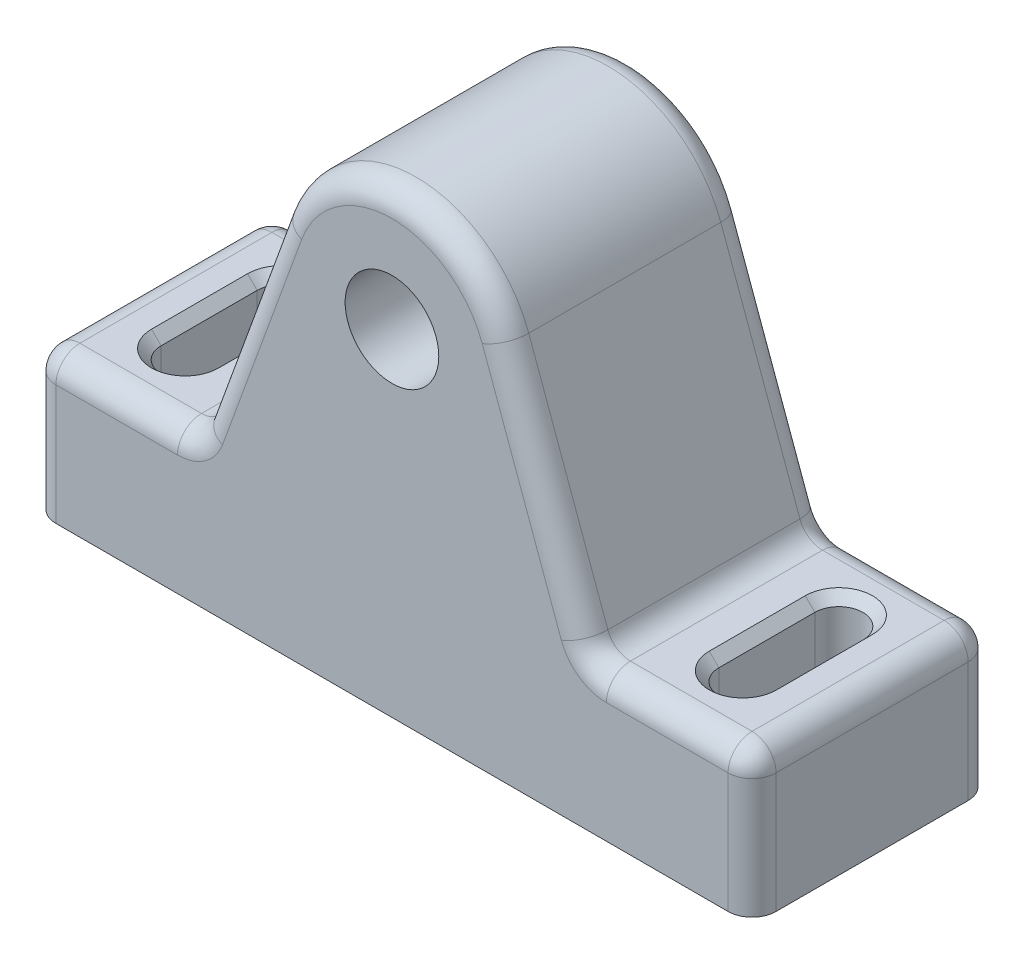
from build123d import *

# Parameters (mm, degrees)
ESQUISSE1_R             = 9.75
BOSS_EXTRU_1_DEPTH      = 25
ENL_V_MAT_EXTRU_1_DEPTH = 103.347447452
CONG_2_R                = 5
CHANFREIN2_SIZE         = 2


with BuildPart() as part:
    # Esquisse1 → Boss.-Extru.1 (new, symmetric)
    with BuildSketch(Plane.XY):
        with BuildLine():
            Line((75, 0), (-75, 0))
            Line((-75, 0), (-75, 30))
            Line((-75, 30), (-41.163253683, 30))
            Line((-41.163253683, 30), (-23.49231552, 78.550503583))
            ThreePointArc((-23.49231552, 78.550503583), (0, 95), (23.49231552, 78.550503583))
            Line((23.49231552, 78.550503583), (41.163253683, 30))
            Line((41.163253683, 30), (75, 30))
            Line((75, 30), (75, 0))
        make_face()
        with Locations((0, 70)):
            Circle(ESQUISSE1_R, mode=Mode.SUBTRACT)
    extrude(amount=BOSS_EXTRU_1_DEPTH, both=True)

    # Esquisse2 → Enl_v. mat.-Extru.1 (cut, through all)
    with BuildSketch(Plane(origin=(0, 30, 0), x_dir=(1, 0, 0), z_dir=(0, 1, 0))):
        with BuildLine():
            Line((-63.081626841, -10), (-63.081626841, 10))
            ThreePointArc((-63.081626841, 10), (-58.081626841, 15), (-53.081626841, 10))
            Line((-53.081626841, 10), (-53.081626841, -10))
            ThreePointArc((-53.081626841, -10), (-58.081626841, -15), (-63.081626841, -10))
        make_face()
        with BuildLine():
            Line((63.081626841, -10), (63.081626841, 10))
            ThreePointArc((63.081626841, 10), (58.081626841, 15), (53.081626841, 10))
            Line((53.081626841, 10), (53.081626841, -10))
            ThreePointArc((53.081626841, -10), (58.081626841, -15), (63.081626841, -10))
        make_face()
    extrude(amount=-ENL_V_MAT_EXTRU_1_DEPTH, mode=Mode.SUBTRACT)

    # Cong_2
    cong_2_edges = [part.edges().sort_by_distance(p)[0] for p in [
        (58.081626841, 30, -25),
        (75, 15, -25),
        (-75, 15, -25),
        (75, 15, 25),
        (-75, 30, 0),
        (-41.163253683, 30, 0),
        (41.163253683, 30, 0),
        (75, 30, 0),
        (58.081626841, 30, 25),
        (32.327784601, 54.275251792, 25),
        (0, 95, 25),
        (-32.327784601, 54.275251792, 25),
        (-58.081626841, 30, 25),
        (-75, 15, 25),
        (-58.081626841, 30, -25),
        (-32.327784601, 54.275251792, -25),
        (0, 95, -25),
        (32.327784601, 54.275251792, -25),
    ]]
    fillet(cong_2_edges, radius=CONG_2_R)

    # Chanfrein2
    chanfrein2_edges = [part.edges().sort_by_distance(p)[0] for p in [
        (-58.081626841, 30, 15),
        (-53.081626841, 30, 0),
        (-58.081626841, 30, -15),
        (-63.081626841, 30, 0),
        (58.081626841, 30, 15),
        (63.081626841, 30, 0),
        (58.081626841, 30, -15),
        (53.081626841, 30, 0),
    ]]
    chamfer(chanfrein2_edges, length=CHANFREIN2_SIZE)


solid = part.part
